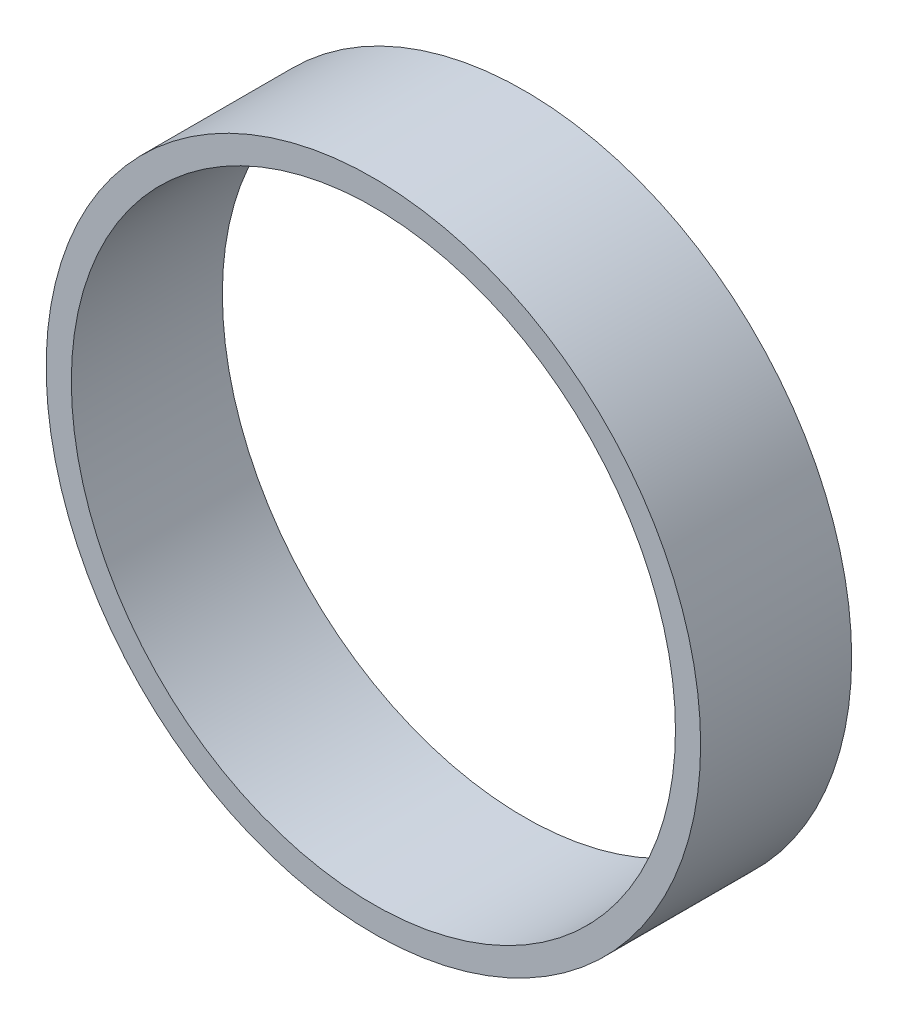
from build123d import *

# Parameters (mm, degrees)
ESQUISSE1_R      = 32.5
ESQUISSE1_R_2    = 30
EXTRUSION1_DEPTH = 15


with BuildPart() as part:
    # Esquisse1 → Extrusion1 (new body)
    with BuildSketch(Plane.XY):
        Circle(ESQUISSE1_R)
        Circle(ESQUISSE1_R_2, mode=Mode.SUBTRACT)
    extrude(amount=EXTRUSION1_DEPTH)


solid = part.part
